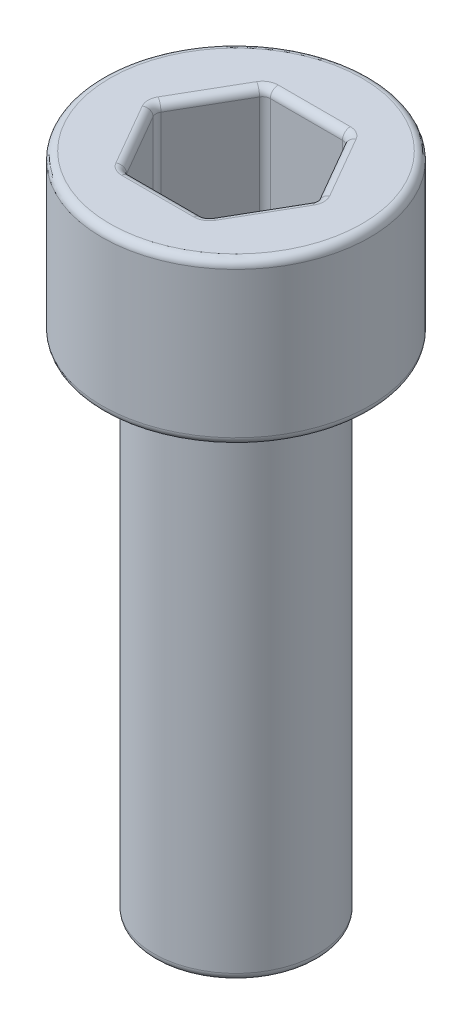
from build123d import *

# Parameters (mm, degrees)
SKETCH_1_R          = 2.085
EXTRUDE_1_DEPTH     = 12.7
SKETCH_2_R          = 3.4
EXTRUDE_2_DEPTH     = 4.1
CUT_EXTRUDE_1_DEPTH = 3
FILLET_1_R          = 0.2


with BuildPart() as part:
    # Sketch 1 → Extrude 1 (new body)
    with BuildSketch(Plane(origin=(0, 0, 0), x_dir=(1, 0, 0), z_dir=(0, 1, 0))):
        with Locations(Location((0, 0, 0), (0, 0, 270))):
            Circle(SKETCH_1_R)
    extrude(amount=-EXTRUDE_1_DEPTH)

    # Sketch 2 → Extrude 2 (add)
    with BuildSketch(Plane(origin=(0, 0, 0), x_dir=(1, 0, 0), z_dir=(0, 1, 0))):
        with Locations(Location((0, 0, 0), (0, 0, 270))):
            Circle(SKETCH_2_R)
    extrude(amount=EXTRUDE_2_DEPTH)

    # Sketch 3 → Cut-Extrude 1 (cut)
    with BuildSketch(Plane(origin=(0, 4.1, 0), x_dir=(1, 0, 0), z_dir=(0, 1, 0))):
        Polygon((2.062222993, 0), (1.031111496, 1.7859375), (-1.031111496, 1.7859375), (-2.062222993, 0), (-1.031111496, -1.7859375), (1.031111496, -1.7859375), align=None)
    extrude(amount=-CUT_EXTRUDE_1_DEPTH, mode=Mode.SUBTRACT)

    # Fillet 1
    fillet_1_edges = [part.edges().sort_by_distance(p)[0] for p in [
        (1.546667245, 1.1, 0.89296875),
        (2.062222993, 2.6, 0),
        (0, 1.1, 1.7859375),
        (1.031111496, 2.6, 1.7859375),
        (-1.546667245, 1.1, 0.89296875),
        (-1.031111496, 2.6, 1.7859375),
        (-1.546667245, 1.1, -0.89296875),
        (-2.062222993, 2.6, 0),
        (0, 1.1, -1.7859375),
        (-1.031111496, 2.6, -1.7859375),
        (1.546667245, 1.1, -0.89296875),
        (1.031111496, 2.6, -1.7859375),
        (1.546667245, 4.1, 0.89296875),
        (1.546667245, 4.1, -0.89296875),
        (0, 4.1, -1.7859375),
        (-1.546667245, 4.1, -0.89296875),
        (-1.546667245, 4.1, 0.89296875),
        (0, 4.1, 1.7859375),
        (0, -12.7, -2.085),
        (0, 0, -3.4),
        (0, 4.1, -3.4),
    ]]
    fillet(fillet_1_edges, radius=FILLET_1_R)


solid = part.part
